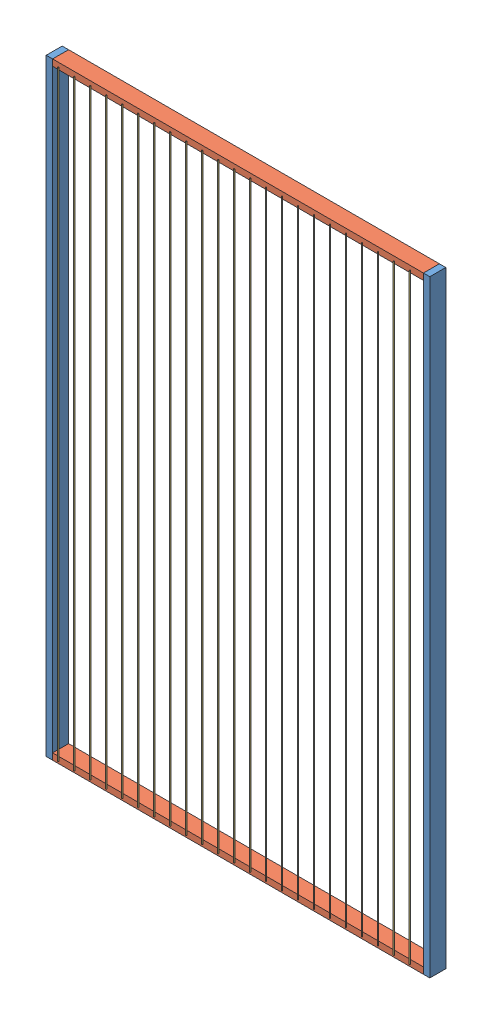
SolidWorks assembly 14E040 grille protection 1900x1200.SLDASM, configuration Défaut (file format 10000). Lengths in mm.
Overall size (1200 1900 55.8).
63 component instances, 4 part files, 15 mates.
Components (placement in the parent):
- 14E026 profilé grillage 1900x50x20-1: 14E026 profilé grillage 1900x50x20.SLDPRT [Défaut] at (-634.6308 -971.9597 25) size (20 1900 50)
- 14E026 profilé grillage 1900x50x20-2: 14E026 profilé grillage 1900x50x20.SLDPRT [Défaut] at (545.3692 -971.9597 25) size (20 1900 50)
- 14E038 profilé grillage 1160x50x20-1: 14E038 profilé grillage 1160x50x20.SLDPRT [Défaut] at (545.3692 -971.9597 25) x (0 1 0) z (0 0 1) size (20 1160 50)
- 14E038 profilé grillage 1160x50x20-2: 14E038 profilé grillage 1160x50x20.SLDPRT [Défaut] at (545.3692 908.0403 25) x (0 1 0) z (0 0 1) size (20 1160 50)
- 14E039 fils horizontal grille 1071 diam 2.5-1: 14E039 fils horizontal grille 1071 diam 2.5.SLDPRT [Défaut] at (-624.6308 876.5622 26.5) x (0 0.83819 -0.545379) z (0 -0.545379 -0.83819) size (3 1180 3)
- 14E039 fils horizontal grille 1071 diam 2.5-2: 14E039 fils horizontal grille 1071 diam 2.5.SLDPRT [Défaut] at (-624.6308 826.5622 26.5) x (0 0.83819 -0.545379) z (0 -0.545379 -0.83819) size (3 1180 3)
- 14E039 fils horizontal grille 1071 diam 2.5-3: 14E039 fils horizontal grille 1071 diam 2.5.SLDPRT [Défaut] at (-624.6308 776.5622 26.5) x (0 0.83819 -0.545379) z (0 -0.545379 -0.83819) size (3 1180 3)
- 14E039 fils horizontal grille 1071 diam 2.5-4: 14E039 fils horizontal grille 1071 diam 2.5.SLDPRT [Défaut] at (-624.6308 726.5622 26.5) x (0 0.83819 -0.545379) z (0 -0.545379 -0.83819) size (3 1180 3)
- 14E039 fils horizontal grille 1071 diam 2.5-5: 14E039 fils horizontal grille 1071 diam 2.5.SLDPRT [Défaut] at (-624.6308 676.5622 26.5) x (0 0.83819 -0.545379) z (0 -0.545379 -0.83819) size (3 1180 3)
- 14E039 fils horizontal grille 1071 diam 2.5-6: 14E039 fils horizontal grille 1071 diam 2.5.SLDPRT [Défaut] at (-624.6308 626.5622 26.5) x (0 0.83819 -0.545379) z (0 -0.545379 -0.83819) size (3 1180 3)
- 14E039 fils horizontal grille 1071 diam 2.5-7: 14E039 fils horizontal grille 1071 diam 2.5.SLDPRT [Défaut] at (-624.6308 576.5622 26.5) x (0 0.83819 -0.545379) z (0 -0.545379 -0.83819) size (3 1180 3)
- 14E039 fils horizontal grille 1071 diam 2.5-8: 14E039 fils horizontal grille 1071 diam 2.5.SLDPRT [Défaut] at (-624.6308 526.5622 26.5) x (0 0.83819 -0.545379) z (0 -0.545379 -0.83819) size (3 1180 3)
- 14E039 fils horizontal grille 1071 diam 2.5-9: 14E039 fils horizontal grille 1071 diam 2.5.SLDPRT [Défaut] at (-624.6308 476.5622 26.5) x (0 0.83819 -0.545379) z (0 -0.545379 -0.83819) size (3 1180 3)
- 14E039 fils horizontal grille 1071 diam 2.5-10: 14E039 fils horizontal grille 1071 diam 2.5.SLDPRT [Défaut] at (-624.6308 426.5622 26.5) x (0 0.83819 -0.545379) z (0 -0.545379 -0.83819) size (3 1180 3)
- 14E039 fils horizontal grille 1071 diam 2.5-11: 14E039 fils horizontal grille 1071 diam 2.5.SLDPRT [Défaut] at (-624.6308 376.5622 26.5) x (0 0.83819 -0.545379) z (0 -0.545379 -0.83819) size (3 1180 3)
- 14E039 fils horizontal grille 1071 diam 2.5-12: 14E039 fils horizontal grille 1071 diam 2.5.SLDPRT [Défaut] at (-624.6308 326.5622 26.5) x (0 0.83819 -0.545379) z (0 -0.545379 -0.83819) size (3 1180 3)
- 14E039 fils horizontal grille 1071 diam 2.5-13: 14E039 fils horizontal grille 1071 diam 2.5.SLDPRT [Défaut] at (-624.6308 276.5622 26.5) x (0 0.83819 -0.545379) z (0 -0.545379 -0.83819) size (3 1180 3)
- 14E039 fils horizontal grille 1071 diam 2.5-14: 14E039 fils horizontal grille 1071 diam 2.5.SLDPRT [Défaut] at (-624.6308 226.5622 26.5) x (0 0.83819 -0.545379) z (0 -0.545379 -0.83819) size (3 1180 3)
- 14E039 fils horizontal grille 1071 diam 2.5-15: 14E039 fils horizontal grille 1071 diam 2.5.SLDPRT [Défaut] at (-624.6308 176.5622 26.5) x (0 0.83819 -0.545379) z (0 -0.545379 -0.83819) size (3 1180 3)
- 14E039 fils horizontal grille 1071 diam 2.5-16: 14E039 fils horizontal grille 1071 diam 2.5.SLDPRT [Défaut] at (-624.6308 126.5622 26.5) x (0 0.83819 -0.545379) z (0 -0.545379 -0.83819) size (3 1180 3)
- 14E039 fils horizontal grille 1071 diam 2.5-17: 14E039 fils horizontal grille 1071 diam 2.5.SLDPRT [Défaut] at (-624.6308 76.5622 26.5) x (0 0.83819 -0.545379) z (0 -0.545379 -0.83819) size (3 1180 3)
- 14E039 fils horizontal grille 1071 diam 2.5-18: 14E039 fils horizontal grille 1071 diam 2.5.SLDPRT [Défaut] at (-624.6308 26.5622 26.5) x (0 0.83819 -0.545379) z (0 -0.545379 -0.83819) size (3 1180 3)
- 14E039 fils horizontal grille 1071 diam 2.5-19: 14E039 fils horizontal grille 1071 diam 2.5.SLDPRT [Défaut] at (-624.6308 -23.4378 26.5) x (0 0.83819 -0.545379) z (0 -0.545379 -0.83819) size (3 1180 3)
- 14E039 fils horizontal grille 1071 diam 2.5-20: 14E039 fils horizontal grille 1071 diam 2.5.SLDPRT [Défaut] at (-624.6308 -73.4378 26.5) x (0 0.83819 -0.545379) z (0 -0.545379 -0.83819) size (3 1180 3)
- 14E039 fils horizontal grille 1071 diam 2.5-21: 14E039 fils horizontal grille 1071 diam 2.5.SLDPRT [Défaut] at (-624.6308 -123.4378 26.5) x (0 0.83819 -0.545379) z (0 -0.545379 -0.83819) size (3 1180 3)
- 14E039 fils horizontal grille 1071 diam 2.5-22: 14E039 fils horizontal grille 1071 diam 2.5.SLDPRT [Défaut] at (-624.6308 -173.4378 26.5) x (0 0.83819 -0.545379) z (0 -0.545379 -0.83819) size (3 1180 3)
- 14E039 fils horizontal grille 1071 diam 2.5-23: 14E039 fils horizontal grille 1071 diam 2.5.SLDPRT [Défaut] at (-624.6308 -223.4378 26.5) x (0 0.83819 -0.545379) z (0 -0.545379 -0.83819) size (3 1180 3)
- 14E039 fils horizontal grille 1071 diam 2.5-24: 14E039 fils horizontal grille 1071 diam 2.5.SLDPRT [Défaut] at (-624.6308 -273.4378 26.5) x (0 0.83819 -0.545379) z (0 -0.545379 -0.83819) size (3 1180 3)
- 14E039 fils horizontal grille 1071 diam 2.5-25: 14E039 fils horizontal grille 1071 diam 2.5.SLDPRT [Défaut] at (-624.6308 -323.4378 26.5) x (0 0.83819 -0.545379) z (0 -0.545379 -0.83819) size (3 1180 3)
- 14E039 fils horizontal grille 1071 diam 2.5-26: 14E039 fils horizontal grille 1071 diam 2.5.SLDPRT [Défaut] at (-624.6308 -373.4378 26.5) x (0 0.83819 -0.545379) z (0 -0.545379 -0.83819) size (3 1180 3)
- 14E039 fils horizontal grille 1071 diam 2.5-27: 14E039 fils horizontal grille 1071 diam 2.5.SLDPRT [Défaut] at (-624.6308 -423.4378 26.5) x (0 0.83819 -0.545379) z (0 -0.545379 -0.83819) size (3 1180 3)
- 14E039 fils horizontal grille 1071 diam 2.5-28: 14E039 fils horizontal grille 1071 diam 2.5.SLDPRT [Défaut] at (-624.6308 -473.4378 26.5) x (0 0.83819 -0.545379) z (0 -0.545379 -0.83819) size (3 1180 3)
- 14E039 fils horizontal grille 1071 diam 2.5-29: 14E039 fils horizontal grille 1071 diam 2.5.SLDPRT [Défaut] at (-624.6308 -523.4378 26.5) x (0 0.83819 -0.545379) z (0 -0.545379 -0.83819) size (3 1180 3)
- 14E039 fils horizontal grille 1071 diam 2.5-30: 14E039 fils horizontal grille 1071 diam 2.5.SLDPRT [Défaut] at (-624.6308 -573.4378 26.5) x (0 0.83819 -0.545379) z (0 -0.545379 -0.83819) size (3 1180 3)
- 14E039 fils horizontal grille 1071 diam 2.5-31: 14E039 fils horizontal grille 1071 diam 2.5.SLDPRT [Défaut] at (-624.6308 -623.4378 26.5) x (0 0.83819 -0.545379) z (0 -0.545379 -0.83819) size (3 1180 3)
- 14E039 fils horizontal grille 1071 diam 2.5-32: 14E039 fils horizontal grille 1071 diam 2.5.SLDPRT [Défaut] at (-624.6308 -673.4378 26.5) x (0 0.83819 -0.545379) z (0 -0.545379 -0.83819) size (3 1180 3)
- 14E039 fils horizontal grille 1071 diam 2.5-33: 14E039 fils horizontal grille 1071 diam 2.5.SLDPRT [Défaut] at (-624.6308 -723.4378 26.5) x (0 0.83819 -0.545379) z (0 -0.545379 -0.83819) size (3 1180 3)
- 14E039 fils horizontal grille 1071 diam 2.5-34: 14E039 fils horizontal grille 1071 diam 2.5.SLDPRT [Défaut] at (-624.6308 -773.4378 26.5) x (0 0.83819 -0.545379) z (0 -0.545379 -0.83819) size (3 1180 3)
- 14E039 fils horizontal grille 1071 diam 2.5-35: 14E039 fils horizontal grille 1071 diam 2.5.SLDPRT [Défaut] at (-624.6308 -823.4378 26.5) x (0 0.83819 -0.545379) z (0 -0.545379 -0.83819) size (3 1180 3)
- 14E039 fils horizontal grille 1071 diam 2.5-36: 14E039 fils horizontal grille 1071 diam 2.5.SLDPRT [Défaut] at (-624.6308 -873.4378 26.5) x (0 0.83819 -0.545379) z (0 -0.545379 -0.83819) size (3 1180 3)
- 14E031 fils vertical grille 1860 diam 3-1: 14E031 fils vertical grille 1860 diam 3.SLDPRT [Défaut] at (-592.8808 -961.9597 29) x (0.973391 0 -0.22915) z (0.22915 0 0.973391) size (3 1880 3)
- 14E031 fils vertical grille 1860 diam 3-2: 14E031 fils vertical grille 1860 diam 3.SLDPRT [Défaut] at (-542.8808 -961.9597 29) x (0.973391 0 -0.22915) z (0.22915 0 0.973391) size (3 1880 3)
- 14E031 fils vertical grille 1860 diam 3-3: 14E031 fils vertical grille 1860 diam 3.SLDPRT [Défaut] at (-492.8808 -961.9597 29) x (0.973391 0 -0.22915) z (0.22915 0 0.973391) size (3 1880 3)
- 14E031 fils vertical grille 1860 diam 3-4: 14E031 fils vertical grille 1860 diam 3.SLDPRT [Défaut] at (-442.8808 -961.9597 29) x (0.973391 0 -0.22915) z (0.22915 0 0.973391) size (3 1880 3)
- 14E031 fils vertical grille 1860 diam 3-5: 14E031 fils vertical grille 1860 diam 3.SLDPRT [Défaut] at (-392.8808 -961.9597 29) x (0.973391 0 -0.22915) z (0.22915 0 0.973391) size (3 1880 3)
- 14E031 fils vertical grille 1860 diam 3-6: 14E031 fils vertical grille 1860 diam 3.SLDPRT [Défaut] at (-342.8808 -961.9597 29) x (0.973391 0 -0.22915) z (0.22915 0 0.973391) size (3 1880 3)
- 14E031 fils vertical grille 1860 diam 3-7: 14E031 fils vertical grille 1860 diam 3.SLDPRT [Défaut] at (-292.8808 -961.9597 29) x (0.973391 0 -0.22915) z (0.22915 0 0.973391) size (3 1880 3)
- 14E031 fils vertical grille 1860 diam 3-8: 14E031 fils vertical grille 1860 diam 3.SLDPRT [Défaut] at (-242.8808 -961.9597 29) x (0.973391 0 -0.22915) z (0.22915 0 0.973391) size (3 1880 3)
- 14E031 fils vertical grille 1860 diam 3-9: 14E031 fils vertical grille 1860 diam 3.SLDPRT [Défaut] at (-192.8808 -961.9597 29) x (0.973391 0 -0.22915) z (0.22915 0 0.973391) size (3 1880 3)
- 14E031 fils vertical grille 1860 diam 3-10: 14E031 fils vertical grille 1860 diam 3.SLDPRT [Défaut] at (-142.8808 -961.9597 29) x (0.973391 0 -0.22915) z (0.22915 0 0.973391) size (3 1880 3)
- 14E031 fils vertical grille 1860 diam 3-11: 14E031 fils vertical grille 1860 diam 3.SLDPRT [Défaut] at (-92.8808 -961.9597 29) x (0.973391 0 -0.22915) z (0.22915 0 0.973391) size (3 1880 3)
- 14E031 fils vertical grille 1860 diam 3-12: 14E031 fils vertical grille 1860 diam 3.SLDPRT [Défaut] at (-42.8808 -961.9597 29) x (0.973391 0 -0.22915) z (0.22915 0 0.973391) size (3 1880 3)
- 14E031 fils vertical grille 1860 diam 3-13: 14E031 fils vertical grille 1860 diam 3.SLDPRT [Défaut] at (7.1192 -961.9597 29) x (0.973391 0 -0.22915) z (0.22915 0 0.973391) size (3 1880 3)
- 14E031 fils vertical grille 1860 diam 3-14: 14E031 fils vertical grille 1860 diam 3.SLDPRT [Défaut] at (57.1192 -961.9597 29) x (0.973391 0 -0.22915) z (0.22915 0 0.973391) size (3 1880 3)
- 14E031 fils vertical grille 1860 diam 3-15: 14E031 fils vertical grille 1860 diam 3.SLDPRT [Défaut] at (107.1192 -961.9597 29) x (0.973391 0 -0.22915) z (0.22915 0 0.973391) size (3 1880 3)
- 14E031 fils vertical grille 1860 diam 3-16: 14E031 fils vertical grille 1860 diam 3.SLDPRT [Défaut] at (157.1192 -961.9597 29) x (0.973391 0 -0.22915) z (0.22915 0 0.973391) size (3 1880 3)
- 14E031 fils vertical grille 1860 diam 3-17: 14E031 fils vertical grille 1860 diam 3.SLDPRT [Défaut] at (207.1192 -961.9597 29) x (0.973391 0 -0.22915) z (0.22915 0 0.973391) size (3 1880 3)
- 14E031 fils vertical grille 1860 diam 3-18: 14E031 fils vertical grille 1860 diam 3.SLDPRT [Défaut] at (257.1192 -961.9597 29) x (0.973391 0 -0.22915) z (0.22915 0 0.973391) size (3 1880 3)
- 14E031 fils vertical grille 1860 diam 3-19: 14E031 fils vertical grille 1860 diam 3.SLDPRT [Défaut] at (307.1192 -961.9597 29) x (0.973391 0 -0.22915) z (0.22915 0 0.973391) size (3 1880 3)
- 14E031 fils vertical grille 1860 diam 3-20: 14E031 fils vertical grille 1860 diam 3.SLDPRT [Défaut] at (357.1192 -961.9597 29) x (0.973391 0 -0.22915) z (0.22915 0 0.973391) size (3 1880 3)
- 14E031 fils vertical grille 1860 diam 3-21: 14E031 fils vertical grille 1860 diam 3.SLDPRT [Défaut] at (407.1192 -961.9597 29) x (0.973391 0 -0.22915) z (0.22915 0 0.973391) size (3 1880 3)
- 14E031 fils vertical grille 1860 diam 3-22: 14E031 fils vertical grille 1860 diam 3.SLDPRT [Défaut] at (457.1192 -961.9597 29) x (0.973391 0 -0.22915) z (0.22915 0 0.973391) size (3 1880 3)
- 14E031 fils vertical grille 1860 diam 3-23: 14E031 fils vertical grille 1860 diam 3.SLDPRT [Défaut] at (507.1192 -961.9597 29) x (0.973391 0 -0.22915) z (0.22915 0 0.973391) size (3 1880 3)
Mates (geometry in assembly coordinates):
- Coïncidente1: coincident anti-aligned: plane of 14E038 profilé grillage 1160x50x20-2 through (-614.6308 908.0403 -25) normal (-1 0 0); plane of 14E026 profilé grillage 1900x50x20-1 through (-614.6308 928.0403 25) normal (1 0 0)
- Coïncidente2: coincident anti-aligned: plane of 14E038 profilé grillage 1160x50x20-2 through (545.3692 908.0403 -25) normal (1 0 0); plane of 14E026 profilé grillage 1900x50x20-2 through (545.3692 928.0403 25) normal (-1 0 0)
- Coïncidente4: coincident aligned: plane of 14E026 profilé grillage 1900x50x20-2 through (545.3692 928.0403 -25) normal (0 0 -1); plane of 14E038 profilé grillage 1160x50x20-2 through (-614.6308 908.0403 -25) normal (0 0 -1)
- Distance1: distance aligned: plane of 14E026 profilé grillage 1900x50x20-2 through (545.3692 928.0403 -25) normal (0 1 0); plane of 14E038 profilé grillage 1160x50x20-2 through (-614.6308 928.0403 25) normal (0 1 0)
- Coïncidente6: coincident aligned: plane of 14E026 profilé grillage 1900x50x20-1 through (-634.6308 928.0403 -25) normal (0 0 -1); plane of 14E038 profilé grillage 1160x50x20-2 through (-614.6308 908.0403 -25) normal (0 0 -1)
- Distance2: distance aligned: plane of 14E026 profilé grillage 1900x50x20-1 through (-634.6308 928.0403 -25) normal (0 1 0); plane of 14E038 profilé grillage 1160x50x20-2 through (-614.6308 928.0403 25) normal (0 1 0)
- Coïncidente8: coincident anti-aligned: plane of 14E026 profilé grillage 1900x50x20-1 through (-614.6308 928.0403 25) normal (1 0 0); plane of 14E038 profilé grillage 1160x50x20-1 through (-614.6308 -971.9597 -25) normal (-1 0 0)
- Coïncidente9: coincident aligned: plane of 14E026 profilé grillage 1900x50x20-1 through (-634.6308 928.0403 -25) normal (0 0 -1); plane of 14E038 profilé grillage 1160x50x20-1 through (-614.6308 -971.9597 -25) normal (0 0 -1)
- Distance3: distance aligned: plane of 14E038 profilé grillage 1160x50x20-1 through (-614.6308 -971.9597 25) normal (0 -1 0); plane of 14E026 profilé grillage 1900x50x20-1 through (-634.6308 -971.9597 -25) normal (0 -1 0)
- Distance4: distance = 10 mm aligned: plane of 14E039 fils horizontal grille 1071 diam 2.5-1 through (555.3692 876.5622 26.5) normal (1 0 0); plane of 14E026 profilé grillage 1900x50x20-2 through (565.3692 928.0403 25) normal (1 0 0)
- Tangent1: tangent anti-aligned: cylinder of 14E039 fils horizontal grille 1071 diam 2.5-1 through (555.3692 876.5622 26.5) axis (-1 0 0) radius 1.5; plane of 14E026 profilé grillage 1900x50x20-2 through (545.3692 928.0403 25) normal (0 0 1)
- Distance5: distance = 50 mm: line of 14E038 profilé grillage 1160x50x20-2 through (-614.6308 928.0403 25) axis (1 0 0); cylinder of 14E039 fils horizontal grille 1071 diam 2.5-1 through (555.3692 876.5622 26.5) axis (-1 0 0) radius 1.5
- Distance6: distance = 10 mm anti-aligned: plane of 14E031 fils vertical grille 1860 diam 3-1 through (-592.8808 918.0403 29) normal (0 1 0); plane of 14E038 profilé grillage 1160x50x20-2 through (-614.6308 908.0403 25) normal (0 -1 0)
- Distance8: distance = 2.5 mm anti-aligned: plane of 14E038 profilé grillage 1160x50x20-2 through (-614.6308 908.0403 25) normal (0 0 1); cylinder of 14E031 fils vertical grille 1860 diam 3-1 through (-592.8808 918.0403 29) axis (0 -1 0) radius 1.5
- Distance10: distance = 20.25 mm anti-aligned: cylinder of 14E031 fils vertical grille 1860 diam 3-1 through (-592.8808 918.0403 29) axis (0 -1 0) radius 1.5; plane of 14E026 profilé grillage 1900x50x20-1 through (-614.6308 928.0403 25) normal (1 0 0)
